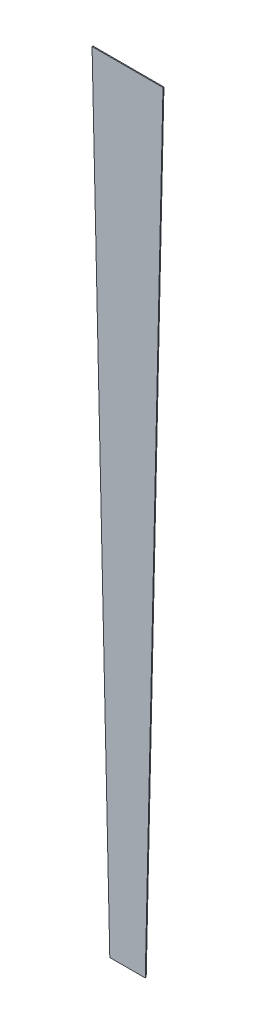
ISO-10303-21;
HEADER;
FILE_DESCRIPTION(('STEP AP214'),'2;1');
FILE_NAME('part.step','',(''),(''),'','','');
FILE_SCHEMA(('AUTOMOTIVE_DESIGN { 1 0 10303 214 1 1 1 1 }'));
ENDSEC;
DATA;
#1=APPLICATION_CONTEXT('core data for automotive mechanical design processes');
#2=APPLICATION_PROTOCOL_DEFINITION('international standard','automotive_design',2000,#1);
#3=PRODUCT_CONTEXT('',#1,'mechanical');
#4=PRODUCT('Part','Part','',(#3));
#5=PRODUCT_RELATED_PRODUCT_CATEGORY('part','',(#4));
#6=PRODUCT_DEFINITION_FORMATION('','',#4);
#7=PRODUCT_DEFINITION_CONTEXT('part definition',#1,'design');
#8=PRODUCT_DEFINITION('design','',#6,#7);
#9=PRODUCT_DEFINITION_SHAPE('','',#8);
#10=(LENGTH_UNIT() NAMED_UNIT(*) SI_UNIT(.MILLI.,.METRE.));
#11=(NAMED_UNIT(*) PLANE_ANGLE_UNIT() SI_UNIT($,.RADIAN.));
#12=(NAMED_UNIT(*) SI_UNIT($,.STERADIAN.) SOLID_ANGLE_UNIT());
#13=UNCERTAINTY_MEASURE_WITH_UNIT(LENGTH_MEASURE(1.E-05),#10,'distance_accuracy_value','');
#14=(GEOMETRIC_REPRESENTATION_CONTEXT(3) GLOBAL_UNCERTAINTY_ASSIGNED_CONTEXT((#13)) GLOBAL_UNIT_ASSIGNED_CONTEXT((#10,
#11,#12)) REPRESENTATION_CONTEXT('',''));
#15=CARTESIAN_POINT('',(0.,0.,0.));
#16=DIRECTION('',(0.,0.,1.));
#17=DIRECTION('',(1.,0.,0.));
#18=AXIS2_PLACEMENT_3D('',#15,#16,#17);
#19=CARTESIAN_POINT('',(-19.0499999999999,-838.2,1.016));
#20=DIRECTION('',(0.999741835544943,0.0227214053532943,0.));
#21=DIRECTION('',(-0.0227214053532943,0.999741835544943,0.));
#22=AXIS2_PLACEMENT_3D('',#19,#20,#21);
#23=PLANE('',#22);
#24=DIRECTION('',(0.0227214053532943,-0.999741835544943,0.));
#25=VECTOR('',#24,1.);
#26=CARTESIAN_POINT('',(-19.0499999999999,-838.2,0.));
#27=LINE('',#26,#25);
#28=CARTESIAN_POINT('',(-38.1,0.,0.));
#29=VERTEX_POINT('',#28);
#30=CARTESIAN_POINT('',(-19.0499999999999,-838.2,0.));
#31=VERTEX_POINT('',#30);
#32=EDGE_CURVE('E87',#29,#31,#27,.T.);
#33=ORIENTED_EDGE('',*,*,#32,.T.);
#34=DIRECTION('',(0.,0.,-1.));
#35=VECTOR('',#34,1.);
#36=CARTESIAN_POINT('',(-19.0499999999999,-838.2,1.016));
#37=LINE('',#36,#35);
#38=CARTESIAN_POINT('',(-19.0499999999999,-838.2,1.016));
#39=VERTEX_POINT('',#38);
#40=EDGE_CURVE('E41',#39,#31,#37,.T.);
#41=ORIENTED_EDGE('',*,*,#40,.F.);
#42=DIRECTION('',(0.0227214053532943,-0.999741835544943,0.));
#43=VECTOR('',#42,1.);
#44=CARTESIAN_POINT('',(-19.0499999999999,-838.2,1.016));
#45=LINE('',#44,#43);
#46=CARTESIAN_POINT('',(-38.1,0.,1.016));
#47=VERTEX_POINT('',#46);
#48=EDGE_CURVE('E80',#47,#39,#45,.T.);
#49=ORIENTED_EDGE('',*,*,#48,.F.);
#50=DIRECTION('',(0.,0.,-1.));
#51=VECTOR('',#50,1.);
#52=CARTESIAN_POINT('',(-38.1,0.,1.016));
#53=LINE('',#52,#51);
#54=EDGE_CURVE('E11',#47,#29,#53,.T.);
#55=ORIENTED_EDGE('',*,*,#54,.T.);
#56=EDGE_LOOP('',(#33,#41,#49,#55));
#57=FACE_BOUND('',#56,.T.);
#58=ADVANCED_FACE('F33',(#57),#23,.F.);
#59=CARTESIAN_POINT('',(19.0500000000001,-838.2,1.016));
#60=DIRECTION('',(0.,1.,0.));
#61=DIRECTION('',(0.,0.,1.));
#62=AXIS2_PLACEMENT_3D('',#59,#60,#61);
#63=PLANE('',#62);
#64=DIRECTION('',(1.,0.,0.));
#65=VECTOR('',#64,1.);
#66=CARTESIAN_POINT('',(19.0500000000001,-838.2,0.));
#67=LINE('',#66,#65);
#68=CARTESIAN_POINT('',(19.0500000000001,-838.2,0.));
#69=VERTEX_POINT('',#68);
#70=EDGE_CURVE('E67',#31,#69,#67,.T.);
#71=ORIENTED_EDGE('',*,*,#70,.T.);
#72=DIRECTION('',(0.,0.,-1.));
#73=VECTOR('',#72,1.);
#74=CARTESIAN_POINT('',(19.0500000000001,-838.2,1.016));
#75=LINE('',#74,#73);
#76=CARTESIAN_POINT('',(19.0500000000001,-838.2,1.016));
#77=VERTEX_POINT('',#76);
#78=EDGE_CURVE('E88',#77,#69,#75,.T.);
#79=ORIENTED_EDGE('',*,*,#78,.F.);
#80=DIRECTION('',(1.,0.,0.));
#81=VECTOR('',#80,1.);
#82=CARTESIAN_POINT('',(19.0500000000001,-838.2,1.016));
#83=LINE('',#82,#81);
#84=EDGE_CURVE('E84',#39,#77,#83,.T.);
#85=ORIENTED_EDGE('',*,*,#84,.F.);
#86=ORIENTED_EDGE('',*,*,#40,.T.);
#87=EDGE_LOOP('',(#71,#79,#85,#86));
#88=FACE_BOUND('',#87,.T.);
#89=ADVANCED_FACE('F89',(#88),#63,.F.);
#90=CARTESIAN_POINT('',(38.1,0.,1.016));
#91=DIRECTION('',(-0.999741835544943,0.022721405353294,0.));
#92=DIRECTION('',(-0.022721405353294,-0.999741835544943,0.));
#93=AXIS2_PLACEMENT_3D('',#90,#91,#92);
#94=PLANE('',#93);
#95=DIRECTION('',(0.022721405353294,0.999741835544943,0.));
#96=VECTOR('',#95,1.);
#97=CARTESIAN_POINT('',(38.1,0.,0.));
#98=LINE('',#97,#96);
#99=CARTESIAN_POINT('',(38.1,0.,0.));
#100=VERTEX_POINT('',#99);
#101=EDGE_CURVE('E74',#69,#100,#98,.T.);
#102=ORIENTED_EDGE('',*,*,#101,.T.);
#103=DIRECTION('',(0.,0.,-1.));
#104=VECTOR('',#103,1.);
#105=CARTESIAN_POINT('',(38.1,0.,1.016));
#106=LINE('',#105,#104);
#107=CARTESIAN_POINT('',(38.1,0.,1.016));
#108=VERTEX_POINT('',#107);
#109=EDGE_CURVE('E93',#108,#100,#106,.T.);
#110=ORIENTED_EDGE('',*,*,#109,.F.);
#111=DIRECTION('',(0.022721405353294,0.999741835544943,0.));
#112=VECTOR('',#111,1.);
#113=CARTESIAN_POINT('',(38.1,0.,1.016));
#114=LINE('',#113,#112);
#115=EDGE_CURVE('E91',#77,#108,#114,.T.);
#116=ORIENTED_EDGE('',*,*,#115,.F.);
#117=ORIENTED_EDGE('',*,*,#78,.T.);
#118=EDGE_LOOP('',(#102,#110,#116,#117));
#119=FACE_BOUND('',#118,.T.);
#120=ADVANCED_FACE('F103',(#119),#94,.F.);
#121=CARTESIAN_POINT('',(0.,0.,1.016));
#122=DIRECTION('',(0.,-1.,0.));
#123=DIRECTION('',(1.,0.,0.));
#124=AXIS2_PLACEMENT_3D('',#121,#122,#123);
#125=PLANE('',#124);
#126=DIRECTION('',(-1.,0.,0.));
#127=VECTOR('',#126,1.);
#128=CARTESIAN_POINT('',(0.,0.,0.));
#129=LINE('',#128,#127);
#130=EDGE_CURVE('E100',#100,#29,#129,.T.);
#131=ORIENTED_EDGE('',*,*,#130,.T.);
#132=ORIENTED_EDGE('',*,*,#54,.F.);
#133=DIRECTION('',(-1.,0.,0.));
#134=VECTOR('',#133,1.);
#135=CARTESIAN_POINT('',(-38.1,0.,1.016));
#136=LINE('',#135,#134);
#137=EDGE_CURVE('E49',#108,#47,#136,.T.);
#138=ORIENTED_EDGE('',*,*,#137,.F.);
#139=ORIENTED_EDGE('',*,*,#109,.T.);
#140=EDGE_LOOP('',(#131,#132,#138,#139));
#141=FACE_BOUND('',#140,.T.);
#142=ADVANCED_FACE('F107',(#141),#125,.F.);
#143=CARTESIAN_POINT('',(0.,0.,1.016));
#144=DIRECTION('',(0.,0.,-1.));
#145=DIRECTION('',(-1.,0.,0.));
#146=AXIS2_PLACEMENT_3D('',#143,#144,#145);
#147=PLANE('',#146);
#148=ORIENTED_EDGE('',*,*,#137,.T.);
#149=ORIENTED_EDGE('',*,*,#48,.T.);
#150=ORIENTED_EDGE('',*,*,#84,.T.);
#151=ORIENTED_EDGE('',*,*,#115,.T.);
#152=EDGE_LOOP('',(#148,#149,#150,#151));
#153=FACE_BOUND('',#152,.T.);
#154=ADVANCED_FACE('F82',(#153),#147,.F.);
#155=CARTESIAN_POINT('',(0.,0.,0.));
#156=DIRECTION('',(0.,0.,-1.));
#157=DIRECTION('',(-1.,0.,0.));
#158=AXIS2_PLACEMENT_3D('',#155,#156,#157);
#159=PLANE('',#158);
#160=ORIENTED_EDGE('',*,*,#32,.F.);
#161=ORIENTED_EDGE('',*,*,#130,.F.);
#162=ORIENTED_EDGE('',*,*,#101,.F.);
#163=ORIENTED_EDGE('',*,*,#70,.F.);
#164=EDGE_LOOP('',(#160,#161,#162,#163));
#165=FACE_BOUND('',#164,.T.);
#166=ADVANCED_FACE('F106',(#165),#159,.T.);
#167=CLOSED_SHELL('',(#58,#89,#120,#142,#154,#166));
#168=MANIFOLD_SOLID_BREP('B2',#167);
#169=ADVANCED_BREP_SHAPE_REPRESENTATION('',(#18,#168),#14);
#170=SHAPE_DEFINITION_REPRESENTATION(#9,#169);
ENDSEC;
END-ISO-10303-21;
